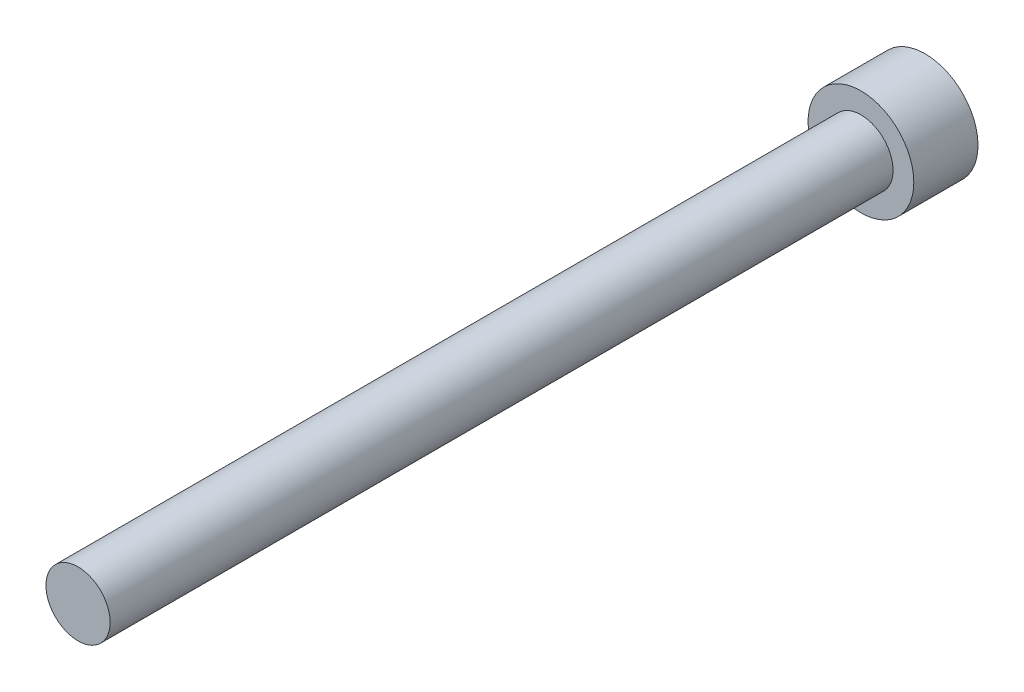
ISO-10303-21;
HEADER;
FILE_DESCRIPTION(('STEP AP214'),'2;1');
FILE_NAME('part.step','',(''),(''),'','','');
FILE_SCHEMA(('AUTOMOTIVE_DESIGN { 1 0 10303 214 1 1 1 1 }'));
ENDSEC;
DATA;
#1=APPLICATION_CONTEXT('core data for automotive mechanical design processes');
#2=APPLICATION_PROTOCOL_DEFINITION('international standard','automotive_design',2000,#1);
#3=PRODUCT_CONTEXT('',#1,'mechanical');
#4=PRODUCT('Part','Part','',(#3));
#5=PRODUCT_RELATED_PRODUCT_CATEGORY('part','',(#4));
#6=PRODUCT_DEFINITION_FORMATION('','',#4);
#7=PRODUCT_DEFINITION_CONTEXT('part definition',#1,'design');
#8=PRODUCT_DEFINITION('design','',#6,#7);
#9=PRODUCT_DEFINITION_SHAPE('','',#8);
#10=(LENGTH_UNIT() NAMED_UNIT(*) SI_UNIT(.MILLI.,.METRE.));
#11=(NAMED_UNIT(*) PLANE_ANGLE_UNIT() SI_UNIT($,.RADIAN.));
#12=(NAMED_UNIT(*) SI_UNIT($,.STERADIAN.) SOLID_ANGLE_UNIT());
#13=UNCERTAINTY_MEASURE_WITH_UNIT(LENGTH_MEASURE(1.E-05),#10,'distance_accuracy_value','');
#14=(GEOMETRIC_REPRESENTATION_CONTEXT(3) GLOBAL_UNCERTAINTY_ASSIGNED_CONTEXT((#13)) GLOBAL_UNIT_ASSIGNED_CONTEXT((#10,
#11,#12)) REPRESENTATION_CONTEXT('',''));
#15=CARTESIAN_POINT('',(0.,0.,0.));
#16=DIRECTION('',(0.,0.,1.));
#17=DIRECTION('',(1.,0.,0.));
#18=AXIS2_PLACEMENT_3D('',#15,#16,#17);
#19=CARTESIAN_POINT('',(0.,0.,50.8));
#20=DIRECTION('',(0.,0.,1.));
#21=DIRECTION('',(1.,0.,0.));
#22=AXIS2_PLACEMENT_3D('',#19,#20,#21);
#23=PLANE('',#22);
#24=CARTESIAN_POINT('',(0.,0.,50.8));
#25=DIRECTION('',(0.,0.,1.));
#26=DIRECTION('',(1.,0.,0.));
#27=AXIS2_PLACEMENT_3D('',#24,#25,#26);
#28=CIRCLE('',#27,2.0828);
#29=CARTESIAN_POINT('',(2.0828,0.,50.8));
#30=VERTEX_POINT('',#29);
#31=EDGE_CURVE('E11',#30,#30,#28,.T.);
#32=ORIENTED_EDGE('',*,*,#31,.T.);
#33=EDGE_LOOP('',(#32));
#34=FACE_BOUND('',#33,.T.);
#35=ADVANCED_FACE('F33',(#34),#23,.T.);
#36=CARTESIAN_POINT('',(0.,0.,50.8));
#37=DIRECTION('',(0.,0.,1.));
#38=DIRECTION('',(1.,0.,0.));
#39=AXIS2_PLACEMENT_3D('',#36,#37,#38);
#40=CYLINDRICAL_SURFACE('',#39,2.0828);
#41=CARTESIAN_POINT('',(0.,0.,0.));
#42=DIRECTION('',(0.,0.,1.));
#43=DIRECTION('',(1.,0.,0.));
#44=AXIS2_PLACEMENT_3D('',#41,#42,#43);
#45=CIRCLE('',#44,2.0828);
#46=CARTESIAN_POINT('',(2.0828,0.,0.));
#47=VERTEX_POINT('',#46);
#48=EDGE_CURVE('E40',#47,#47,#45,.T.);
#49=ORIENTED_EDGE('',*,*,#48,.T.);
#50=EDGE_LOOP('',(#49));
#51=FACE_BOUND('',#50,.T.);
#52=ORIENTED_EDGE('',*,*,#31,.F.);
#53=EDGE_LOOP('',(#52));
#54=FACE_BOUND('',#53,.T.);
#55=ADVANCED_FACE('F147',(#51,#54),#40,.T.);
#56=CARTESIAN_POINT('',(0.,-2.0828,0.));
#57=DIRECTION('',(0.,0.,1.));
#58=DIRECTION('',(1.,0.,0.));
#59=AXIS2_PLACEMENT_3D('',#56,#57,#58);
#60=PLANE('',#59);
#61=CARTESIAN_POINT('',(0.,0.,0.));
#62=DIRECTION('',(0.,0.,1.));
#63=DIRECTION('',(1.,0.,0.));
#64=AXIS2_PLACEMENT_3D('',#61,#62,#63);
#65=CIRCLE('',#64,3.429);
#66=CARTESIAN_POINT('',(3.429,0.,0.));
#67=VERTEX_POINT('',#66);
#68=EDGE_CURVE('E142',#67,#67,#65,.T.);
#69=ORIENTED_EDGE('',*,*,#68,.T.);
#70=EDGE_LOOP('',(#69));
#71=FACE_BOUND('',#70,.T.);
#72=ORIENTED_EDGE('',*,*,#48,.F.);
#73=EDGE_LOOP('',(#72));
#74=FACE_BOUND('',#73,.T.);
#75=ADVANCED_FACE('F150',(#71,#74),#60,.T.);
#76=CARTESIAN_POINT('',(0.,0.,50.8));
#77=DIRECTION('',(0.,0.,1.));
#78=DIRECTION('',(1.,0.,0.));
#79=AXIS2_PLACEMENT_3D('',#76,#77,#78);
#80=CYLINDRICAL_SURFACE('',#79,3.429);
#81=CARTESIAN_POINT('',(0.,0.,-4.1656));
#82=DIRECTION('',(0.,0.,1.));
#83=DIRECTION('',(1.,0.,0.));
#84=AXIS2_PLACEMENT_3D('',#81,#82,#83);
#85=CIRCLE('',#84,3.429);
#86=CARTESIAN_POINT('',(3.429,0.,-4.1656));
#87=VERTEX_POINT('',#86);
#88=EDGE_CURVE('E134',#87,#87,#85,.T.);
#89=ORIENTED_EDGE('',*,*,#88,.T.);
#90=EDGE_LOOP('',(#89));
#91=FACE_BOUND('',#90,.T.);
#92=ORIENTED_EDGE('',*,*,#68,.F.);
#93=EDGE_LOOP('',(#92));
#94=FACE_BOUND('',#93,.T.);
#95=ADVANCED_FACE('F152',(#91,#94),#80,.T.);
#96=CARTESIAN_POINT('',(0.,-3.429,-4.1656));
#97=DIRECTION('',(0.,0.,-1.));
#98=DIRECTION('',(-1.,0.,0.));
#99=AXIS2_PLACEMENT_3D('',#96,#97,#98);
#100=PLANE('',#99);
#101=DIRECTION('',(0.866025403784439,-0.5,0.));
#102=VECTOR('',#101,1.);
#103=CARTESIAN_POINT('',(0.,2.05305755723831,-4.1656));
#104=LINE('',#103,#102);
#105=CARTESIAN_POINT('',(0.,2.05305755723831,-4.1656));
#106=VERTEX_POINT('',#105);
#107=CARTESIAN_POINT('',(1.778,1.02652877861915,-4.1656));
#108=VERTEX_POINT('',#107);
#109=EDGE_CURVE('E47',#106,#108,#104,.T.);
#110=ORIENTED_EDGE('',*,*,#109,.F.);
#111=DIRECTION('',(0.866025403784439,0.5,0.));
#112=VECTOR('',#111,1.);
#113=CARTESIAN_POINT('',(-1.778,1.02652877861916,-4.1656));
#114=LINE('',#113,#112);
#115=CARTESIAN_POINT('',(-1.778,1.02652877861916,-4.1656));
#116=VERTEX_POINT('',#115);
#117=EDGE_CURVE('E130',#116,#106,#114,.T.);
#118=ORIENTED_EDGE('',*,*,#117,.F.);
#119=DIRECTION('',(0.,1.,0.));
#120=VECTOR('',#119,1.);
#121=CARTESIAN_POINT('',(-1.778,-1.02652877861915,-4.1656));
#122=LINE('',#121,#120);
#123=CARTESIAN_POINT('',(-1.778,-1.02652877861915,-4.1656));
#124=VERTEX_POINT('',#123);
#125=EDGE_CURVE('E128',#124,#116,#122,.T.);
#126=ORIENTED_EDGE('',*,*,#125,.F.);
#127=DIRECTION('',(-0.866025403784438,0.5,0.));
#128=VECTOR('',#127,1.);
#129=CARTESIAN_POINT('',(0.,-2.05305755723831,-4.1656));
#130=LINE('',#129,#128);
#131=CARTESIAN_POINT('',(0.,-2.05305755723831,-4.1656));
#132=VERTEX_POINT('',#131);
#133=EDGE_CURVE('E95',#132,#124,#130,.T.);
#134=ORIENTED_EDGE('',*,*,#133,.F.);
#135=DIRECTION('',(-0.866025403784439,-0.5,0.));
#136=VECTOR('',#135,1.);
#137=CARTESIAN_POINT('',(1.778,-1.02652877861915,-4.1656));
#138=LINE('',#137,#136);
#139=CARTESIAN_POINT('',(1.778,-1.02652877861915,-4.1656));
#140=VERTEX_POINT('',#139);
#141=EDGE_CURVE('E124',#140,#132,#138,.T.);
#142=ORIENTED_EDGE('',*,*,#141,.F.);
#143=DIRECTION('',(0.,-1.,0.));
#144=VECTOR('',#143,1.);
#145=CARTESIAN_POINT('',(1.778,1.02652877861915,-4.1656));
#146=LINE('',#145,#144);
#147=EDGE_CURVE('E121',#108,#140,#146,.T.);
#148=ORIENTED_EDGE('',*,*,#147,.F.);
#149=EDGE_LOOP('',(#110,#118,#126,#134,#142,#148));
#150=FACE_BOUND('',#149,.T.);
#151=ORIENTED_EDGE('',*,*,#88,.F.);
#152=EDGE_LOOP('',(#151));
#153=FACE_BOUND('',#152,.T.);
#154=ADVANCED_FACE('F159',(#150,#153),#100,.T.);
#155=CARTESIAN_POINT('',(0.,2.05305755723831,-1.3716));
#156=DIRECTION('',(0.5,0.866025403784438,0.));
#157=DIRECTION('',(-0.866025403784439,0.5,0.));
#158=AXIS2_PLACEMENT_3D('',#155,#156,#157);
#159=PLANE('',#158);
#160=ORIENTED_EDGE('',*,*,#109,.T.);
#161=DIRECTION('',(0.,0.,-1.));
#162=VECTOR('',#161,1.);
#163=CARTESIAN_POINT('',(1.778,1.02652877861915,-1.3716));
#164=LINE('',#163,#162);
#165=CARTESIAN_POINT('',(1.778,1.02652877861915,-1.3716));
#166=VERTEX_POINT('',#165);
#167=EDGE_CURVE('E77',#166,#108,#164,.T.);
#168=ORIENTED_EDGE('',*,*,#167,.F.);
#169=DIRECTION('',(0.866025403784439,-0.5,0.));
#170=VECTOR('',#169,1.);
#171=CARTESIAN_POINT('',(0.,2.05305755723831,-1.3716));
#172=LINE('',#171,#170);
#173=CARTESIAN_POINT('',(0.,2.05305755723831,-1.3716));
#174=VERTEX_POINT('',#173);
#175=EDGE_CURVE('E132',#174,#166,#172,.T.);
#176=ORIENTED_EDGE('',*,*,#175,.F.);
#177=DIRECTION('',(0.,0.,-1.));
#178=VECTOR('',#177,1.);
#179=CARTESIAN_POINT('',(0.,2.05305755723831,-1.3716));
#180=LINE('',#179,#178);
#181=EDGE_CURVE('E55',#174,#106,#180,.T.);
#182=ORIENTED_EDGE('',*,*,#181,.T.);
#183=EDGE_LOOP('',(#160,#168,#176,#182));
#184=FACE_BOUND('',#183,.T.);
#185=ADVANCED_FACE('F190',(#184),#159,.F.);
#186=CARTESIAN_POINT('',(-1.778,1.02652877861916,-1.3716));
#187=DIRECTION('',(-0.5,0.866025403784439,0.));
#188=DIRECTION('',(-0.866025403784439,-0.5,0.));
#189=AXIS2_PLACEMENT_3D('',#186,#187,#188);
#190=PLANE('',#189);
#191=ORIENTED_EDGE('',*,*,#117,.T.);
#192=ORIENTED_EDGE('',*,*,#181,.F.);
#193=DIRECTION('',(0.866025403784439,0.5,0.));
#194=VECTOR('',#193,1.);
#195=CARTESIAN_POINT('',(-1.778,1.02652877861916,-1.3716));
#196=LINE('',#195,#194);
#197=CARTESIAN_POINT('',(-1.778,1.02652877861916,-1.3716));
#198=VERTEX_POINT('',#197);
#199=EDGE_CURVE('E107',#198,#174,#196,.T.);
#200=ORIENTED_EDGE('',*,*,#199,.F.);
#201=DIRECTION('',(0.,0.,-1.));
#202=VECTOR('',#201,1.);
#203=CARTESIAN_POINT('',(-1.778,1.02652877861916,-1.3716));
#204=LINE('',#203,#202);
#205=EDGE_CURVE('E99',#198,#116,#204,.T.);
#206=ORIENTED_EDGE('',*,*,#205,.T.);
#207=EDGE_LOOP('',(#191,#192,#200,#206));
#208=FACE_BOUND('',#207,.T.);
#209=ADVANCED_FACE('F200',(#208),#190,.F.);
#210=CARTESIAN_POINT('',(-1.778,-1.02652877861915,-1.3716));
#211=DIRECTION('',(-1.,0.,0.));
#212=DIRECTION('',(0.,0.,1.));
#213=AXIS2_PLACEMENT_3D('',#210,#211,#212);
#214=PLANE('',#213);
#215=ORIENTED_EDGE('',*,*,#125,.T.);
#216=ORIENTED_EDGE('',*,*,#205,.F.);
#217=DIRECTION('',(0.,1.,0.));
#218=VECTOR('',#217,1.);
#219=CARTESIAN_POINT('',(-1.778,-1.02652877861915,-1.3716));
#220=LINE('',#219,#218);
#221=CARTESIAN_POINT('',(-1.778,-1.02652877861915,-1.3716));
#222=VERTEX_POINT('',#221);
#223=EDGE_CURVE('E103',#222,#198,#220,.T.);
#224=ORIENTED_EDGE('',*,*,#223,.F.);
#225=DIRECTION('',(0.,0.,-1.));
#226=VECTOR('',#225,1.);
#227=CARTESIAN_POINT('',(-1.778,-1.02652877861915,-1.3716));
#228=LINE('',#227,#226);
#229=EDGE_CURVE('E88',#222,#124,#228,.T.);
#230=ORIENTED_EDGE('',*,*,#229,.T.);
#231=EDGE_LOOP('',(#215,#216,#224,#230));
#232=FACE_BOUND('',#231,.T.);
#233=ADVANCED_FACE('F104',(#232),#214,.F.);
#234=CARTESIAN_POINT('',(0.,-2.05305755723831,-1.3716));
#235=DIRECTION('',(-0.5,-0.866025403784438,0.));
#236=DIRECTION('',(0.866025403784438,-0.5,0.));
#237=AXIS2_PLACEMENT_3D('',#234,#235,#236);
#238=PLANE('',#237);
#239=ORIENTED_EDGE('',*,*,#133,.T.);
#240=ORIENTED_EDGE('',*,*,#229,.F.);
#241=DIRECTION('',(-0.866025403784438,0.5,0.));
#242=VECTOR('',#241,1.);
#243=CARTESIAN_POINT('',(0.,-2.05305755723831,-1.3716));
#244=LINE('',#243,#242);
#245=CARTESIAN_POINT('',(0.,-2.05305755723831,-1.3716));
#246=VERTEX_POINT('',#245);
#247=EDGE_CURVE('E92',#246,#222,#244,.T.);
#248=ORIENTED_EDGE('',*,*,#247,.F.);
#249=DIRECTION('',(0.,0.,-1.));
#250=VECTOR('',#249,1.);
#251=CARTESIAN_POINT('',(0.,-2.05305755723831,-1.3716));
#252=LINE('',#251,#250);
#253=EDGE_CURVE('E100',#246,#132,#252,.T.);
#254=ORIENTED_EDGE('',*,*,#253,.T.);
#255=EDGE_LOOP('',(#239,#240,#248,#254));
#256=FACE_BOUND('',#255,.T.);
#257=ADVANCED_FACE('F90',(#256),#238,.F.);
#258=CARTESIAN_POINT('',(1.778,-1.02652877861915,-1.3716));
#259=DIRECTION('',(0.5,-0.866025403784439,0.));
#260=DIRECTION('',(0.866025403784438,0.5,0.));
#261=AXIS2_PLACEMENT_3D('',#258,#259,#260);
#262=PLANE('',#261);
#263=ORIENTED_EDGE('',*,*,#141,.T.);
#264=ORIENTED_EDGE('',*,*,#253,.F.);
#265=DIRECTION('',(-0.866025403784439,-0.5,0.));
#266=VECTOR('',#265,1.);
#267=CARTESIAN_POINT('',(1.778,-1.02652877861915,-1.3716));
#268=LINE('',#267,#266);
#269=CARTESIAN_POINT('',(1.778,-1.02652877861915,-1.3716));
#270=VERTEX_POINT('',#269);
#271=EDGE_CURVE('E113',#270,#246,#268,.T.);
#272=ORIENTED_EDGE('',*,*,#271,.F.);
#273=DIRECTION('',(0.,0.,-1.));
#274=VECTOR('',#273,1.);
#275=CARTESIAN_POINT('',(1.778,-1.02652877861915,-1.3716));
#276=LINE('',#275,#274);
#277=EDGE_CURVE('E137',#270,#140,#276,.T.);
#278=ORIENTED_EDGE('',*,*,#277,.T.);
#279=EDGE_LOOP('',(#263,#264,#272,#278));
#280=FACE_BOUND('',#279,.T.);
#281=ADVANCED_FACE('F225',(#280),#262,.F.);
#282=CARTESIAN_POINT('',(1.778,1.02652877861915,-1.3716));
#283=DIRECTION('',(1.,0.,0.));
#284=DIRECTION('',(0.,0.,-1.));
#285=AXIS2_PLACEMENT_3D('',#282,#283,#284);
#286=PLANE('',#285);
#287=ORIENTED_EDGE('',*,*,#147,.T.);
#288=ORIENTED_EDGE('',*,*,#277,.F.);
#289=DIRECTION('',(0.,-1.,0.));
#290=VECTOR('',#289,1.);
#291=CARTESIAN_POINT('',(1.778,1.02652877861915,-1.3716));
#292=LINE('',#291,#290);
#293=EDGE_CURVE('E115',#166,#270,#292,.T.);
#294=ORIENTED_EDGE('',*,*,#293,.F.);
#295=ORIENTED_EDGE('',*,*,#167,.T.);
#296=EDGE_LOOP('',(#287,#288,#294,#295));
#297=FACE_BOUND('',#296,.T.);
#298=ADVANCED_FACE('F234',(#297),#286,.F.);
#299=CARTESIAN_POINT('',(3.556,0.,-1.3716));
#300=DIRECTION('',(0.,0.,-1.));
#301=DIRECTION('',(-1.,0.,0.));
#302=AXIS2_PLACEMENT_3D('',#299,#300,#301);
#303=PLANE('',#302);
#304=ORIENTED_EDGE('',*,*,#175,.T.);
#305=ORIENTED_EDGE('',*,*,#293,.T.);
#306=ORIENTED_EDGE('',*,*,#271,.T.);
#307=ORIENTED_EDGE('',*,*,#247,.T.);
#308=ORIENTED_EDGE('',*,*,#223,.T.);
#309=ORIENTED_EDGE('',*,*,#199,.T.);
#310=EDGE_LOOP('',(#304,#305,#306,#307,#308,#309));
#311=FACE_BOUND('',#310,.T.);
#312=ADVANCED_FACE('F110',(#311),#303,.T.);
#313=CLOSED_SHELL('',(#35,#55,#75,#95,#154,#185,#209,#233,#257,#281,#298,#312));
#314=MANIFOLD_SOLID_BREP('B2',#313);
#315=ADVANCED_BREP_SHAPE_REPRESENTATION('',(#18,#314),#14);
#316=SHAPE_DEFINITION_REPRESENTATION(#9,#315);
ENDSEC;
END-ISO-10303-21;
